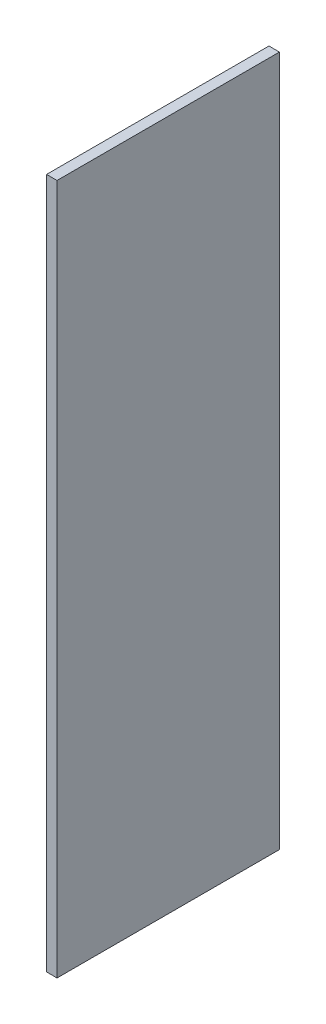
ISO-10303-21;
HEADER;
FILE_DESCRIPTION(('STEP AP214'),'2;1');
FILE_NAME('part.step','',(''),(''),'','','');
FILE_SCHEMA(('AUTOMOTIVE_DESIGN { 1 0 10303 214 1 1 1 1 }'));
ENDSEC;
DATA;
#1=APPLICATION_CONTEXT('core data for automotive mechanical design processes');
#2=APPLICATION_PROTOCOL_DEFINITION('international standard','automotive_design',2000,#1);
#3=PRODUCT_CONTEXT('',#1,'mechanical');
#4=PRODUCT('Part','Part','',(#3));
#5=PRODUCT_RELATED_PRODUCT_CATEGORY('part','',(#4));
#6=PRODUCT_DEFINITION_FORMATION('','',#4);
#7=PRODUCT_DEFINITION_CONTEXT('part definition',#1,'design');
#8=PRODUCT_DEFINITION('design','',#6,#7);
#9=PRODUCT_DEFINITION_SHAPE('','',#8);
#10=(LENGTH_UNIT() NAMED_UNIT(*) SI_UNIT(.MILLI.,.METRE.));
#11=(NAMED_UNIT(*) PLANE_ANGLE_UNIT() SI_UNIT($,.RADIAN.));
#12=(NAMED_UNIT(*) SI_UNIT($,.STERADIAN.) SOLID_ANGLE_UNIT());
#13=UNCERTAINTY_MEASURE_WITH_UNIT(LENGTH_MEASURE(1.E-05),#10,'distance_accuracy_value','');
#14=(GEOMETRIC_REPRESENTATION_CONTEXT(3) GLOBAL_UNCERTAINTY_ASSIGNED_CONTEXT((#13)) GLOBAL_UNIT_ASSIGNED_CONTEXT((#10,
#11,#12)) REPRESENTATION_CONTEXT('',''));
#15=CARTESIAN_POINT('',(0.,0.,0.));
#16=DIRECTION('',(0.,0.,1.));
#17=DIRECTION('',(1.,0.,0.));
#18=AXIS2_PLACEMENT_3D('',#15,#16,#17);
#19=CARTESIAN_POINT('',(6.35,158.622213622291,71.3588622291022));
#20=DIRECTION('',(0.,0.,-1.));
#21=DIRECTION('',(0.,1.,0.));
#22=AXIS2_PLACEMENT_3D('',#19,#20,#21);
#23=PLANE('',#22);
#24=DIRECTION('',(0.,-1.,0.));
#25=VECTOR('',#24,1.);
#26=CARTESIAN_POINT('',(0.,158.622213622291,71.3588622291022));
#27=LINE('',#26,#25);
#28=CARTESIAN_POINT('',(0.,158.622213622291,71.3588622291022));
#29=VERTEX_POINT('',#28);
#30=CARTESIAN_POINT('',(0.,-260.477786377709,71.3588622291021));
#31=VERTEX_POINT('',#30);
#32=EDGE_CURVE('E97',#29,#31,#27,.T.);
#33=ORIENTED_EDGE('',*,*,#32,.T.);
#34=DIRECTION('',(-1.,0.,0.));
#35=VECTOR('',#34,1.);
#36=CARTESIAN_POINT('',(6.35,-260.477786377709,71.3588622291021));
#37=LINE('',#36,#35);
#38=CARTESIAN_POINT('',(6.35,-260.477786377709,71.3588622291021));
#39=VERTEX_POINT('',#38);
#40=EDGE_CURVE('E11',#39,#31,#37,.T.);
#41=ORIENTED_EDGE('',*,*,#40,.F.);
#42=DIRECTION('',(0.,-1.,0.));
#43=VECTOR('',#42,1.);
#44=CARTESIAN_POINT('',(6.35,158.622213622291,71.3588622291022));
#45=LINE('',#44,#43);
#46=CARTESIAN_POINT('',(6.35,158.622213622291,71.3588622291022));
#47=VERTEX_POINT('',#46);
#48=EDGE_CURVE('E85',#47,#39,#45,.T.);
#49=ORIENTED_EDGE('',*,*,#48,.F.);
#50=DIRECTION('',(-1.,0.,0.));
#51=VECTOR('',#50,1.);
#52=CARTESIAN_POINT('',(6.35,158.622213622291,71.3588622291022));
#53=LINE('',#52,#51);
#54=EDGE_CURVE('E93',#47,#29,#53,.T.);
#55=ORIENTED_EDGE('',*,*,#54,.T.);
#56=EDGE_LOOP('',(#33,#41,#49,#55));
#57=FACE_BOUND('',#56,.T.);
#58=ADVANCED_FACE('F34',(#57),#23,.F.);
#59=CARTESIAN_POINT('',(6.35,-260.477786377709,71.3588622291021));
#60=DIRECTION('',(0.,1.,0.));
#61=DIRECTION('',(0.,0.,1.));
#62=AXIS2_PLACEMENT_3D('',#59,#60,#61);
#63=PLANE('',#62);
#64=DIRECTION('',(0.,0.,-1.));
#65=VECTOR('',#64,1.);
#66=CARTESIAN_POINT('',(0.,-260.477786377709,71.3588622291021));
#67=LINE('',#66,#65);
#68=CARTESIAN_POINT('',(0.,-260.477786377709,-63.5786377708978));
#69=VERTEX_POINT('',#68);
#70=EDGE_CURVE('E89',#31,#69,#67,.T.);
#71=ORIENTED_EDGE('',*,*,#70,.T.);
#72=DIRECTION('',(-1.,0.,0.));
#73=VECTOR('',#72,1.);
#74=CARTESIAN_POINT('',(6.35,-260.477786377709,-63.5786377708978));
#75=LINE('',#74,#73);
#76=CARTESIAN_POINT('',(6.35,-260.477786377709,-63.5786377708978));
#77=VERTEX_POINT('',#76);
#78=EDGE_CURVE('E42',#77,#69,#75,.T.);
#79=ORIENTED_EDGE('',*,*,#78,.F.);
#80=DIRECTION('',(0.,0.,-1.));
#81=VECTOR('',#80,1.);
#82=CARTESIAN_POINT('',(6.35,-260.477786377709,71.3588622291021));
#83=LINE('',#82,#81);
#84=EDGE_CURVE('E80',#39,#77,#83,.T.);
#85=ORIENTED_EDGE('',*,*,#84,.F.);
#86=ORIENTED_EDGE('',*,*,#40,.T.);
#87=EDGE_LOOP('',(#71,#79,#85,#86));
#88=FACE_BOUND('',#87,.T.);
#89=ADVANCED_FACE('F88',(#88),#63,.F.);
#90=CARTESIAN_POINT('',(6.35,158.622213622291,-63.5786377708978));
#91=DIRECTION('',(0.,0.,1.));
#92=DIRECTION('',(1.,0.,0.));
#93=AXIS2_PLACEMENT_3D('',#90,#91,#92);
#94=PLANE('',#93);
#95=DIRECTION('',(0.,1.,0.));
#96=VECTOR('',#95,1.);
#97=CARTESIAN_POINT('',(0.,158.622213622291,-63.5786377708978));
#98=LINE('',#97,#96);
#99=CARTESIAN_POINT('',(0.,158.622213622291,-63.5786377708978));
#100=VERTEX_POINT('',#99);
#101=EDGE_CURVE('E67',#69,#100,#98,.T.);
#102=ORIENTED_EDGE('',*,*,#101,.T.);
#103=DIRECTION('',(-1.,0.,0.));
#104=VECTOR('',#103,1.);
#105=CARTESIAN_POINT('',(6.35,158.622213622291,-63.5786377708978));
#106=LINE('',#105,#104);
#107=CARTESIAN_POINT('',(6.35,158.622213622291,-63.5786377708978));
#108=VERTEX_POINT('',#107);
#109=EDGE_CURVE('E90',#108,#100,#106,.T.);
#110=ORIENTED_EDGE('',*,*,#109,.F.);
#111=DIRECTION('',(0.,1.,0.));
#112=VECTOR('',#111,1.);
#113=CARTESIAN_POINT('',(6.35,158.622213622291,-63.5786377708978));
#114=LINE('',#113,#112);
#115=EDGE_CURVE('E83',#77,#108,#114,.T.);
#116=ORIENTED_EDGE('',*,*,#115,.F.);
#117=ORIENTED_EDGE('',*,*,#78,.T.);
#118=EDGE_LOOP('',(#102,#110,#116,#117));
#119=FACE_BOUND('',#118,.T.);
#120=ADVANCED_FACE('F91',(#119),#94,.F.);
#121=CARTESIAN_POINT('',(6.35,158.622213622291,71.3588622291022));
#122=DIRECTION('',(0.,-1.,0.));
#123=DIRECTION('',(0.,0.,-1.));
#124=AXIS2_PLACEMENT_3D('',#121,#122,#123);
#125=PLANE('',#124);
#126=DIRECTION('',(0.,0.,1.));
#127=VECTOR('',#126,1.);
#128=CARTESIAN_POINT('',(0.,158.622213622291,71.3588622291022));
#129=LINE('',#128,#127);
#130=EDGE_CURVE('E73',#100,#29,#129,.T.);
#131=ORIENTED_EDGE('',*,*,#130,.T.);
#132=ORIENTED_EDGE('',*,*,#54,.F.);
#133=DIRECTION('',(0.,0.,1.));
#134=VECTOR('',#133,1.);
#135=CARTESIAN_POINT('',(6.35,158.622213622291,71.3588622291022));
#136=LINE('',#135,#134);
#137=EDGE_CURVE('E50',#108,#47,#136,.T.);
#138=ORIENTED_EDGE('',*,*,#137,.F.);
#139=ORIENTED_EDGE('',*,*,#109,.T.);
#140=EDGE_LOOP('',(#131,#132,#138,#139));
#141=FACE_BOUND('',#140,.T.);
#142=ADVANCED_FACE('F104',(#141),#125,.F.);
#143=CARTESIAN_POINT('',(6.35,0.,0.));
#144=DIRECTION('',(1.,0.,0.));
#145=DIRECTION('',(0.,0.,-1.));
#146=AXIS2_PLACEMENT_3D('',#143,#144,#145);
#147=PLANE('',#146);
#148=ORIENTED_EDGE('',*,*,#48,.T.);
#149=ORIENTED_EDGE('',*,*,#84,.T.);
#150=ORIENTED_EDGE('',*,*,#115,.T.);
#151=ORIENTED_EDGE('',*,*,#137,.T.);
#152=EDGE_LOOP('',(#148,#149,#150,#151));
#153=FACE_BOUND('',#152,.T.);
#154=ADVANCED_FACE('F81',(#153),#147,.T.);
#155=CARTESIAN_POINT('',(0.,0.,0.));
#156=DIRECTION('',(1.,0.,0.));
#157=DIRECTION('',(0.,0.,-1.));
#158=AXIS2_PLACEMENT_3D('',#155,#156,#157);
#159=PLANE('',#158);
#160=ORIENTED_EDGE('',*,*,#32,.F.);
#161=ORIENTED_EDGE('',*,*,#130,.F.);
#162=ORIENTED_EDGE('',*,*,#101,.F.);
#163=ORIENTED_EDGE('',*,*,#70,.F.);
#164=EDGE_LOOP('',(#160,#161,#162,#163));
#165=FACE_BOUND('',#164,.T.);
#166=ADVANCED_FACE('F107',(#165),#159,.F.);
#167=CLOSED_SHELL('',(#58,#89,#120,#142,#154,#166));
#168=MANIFOLD_SOLID_BREP('B2',#167);
#169=ADVANCED_BREP_SHAPE_REPRESENTATION('',(#18,#168),#14);
#170=SHAPE_DEFINITION_REPRESENTATION(#9,#169);
ENDSEC;
END-ISO-10303-21;
